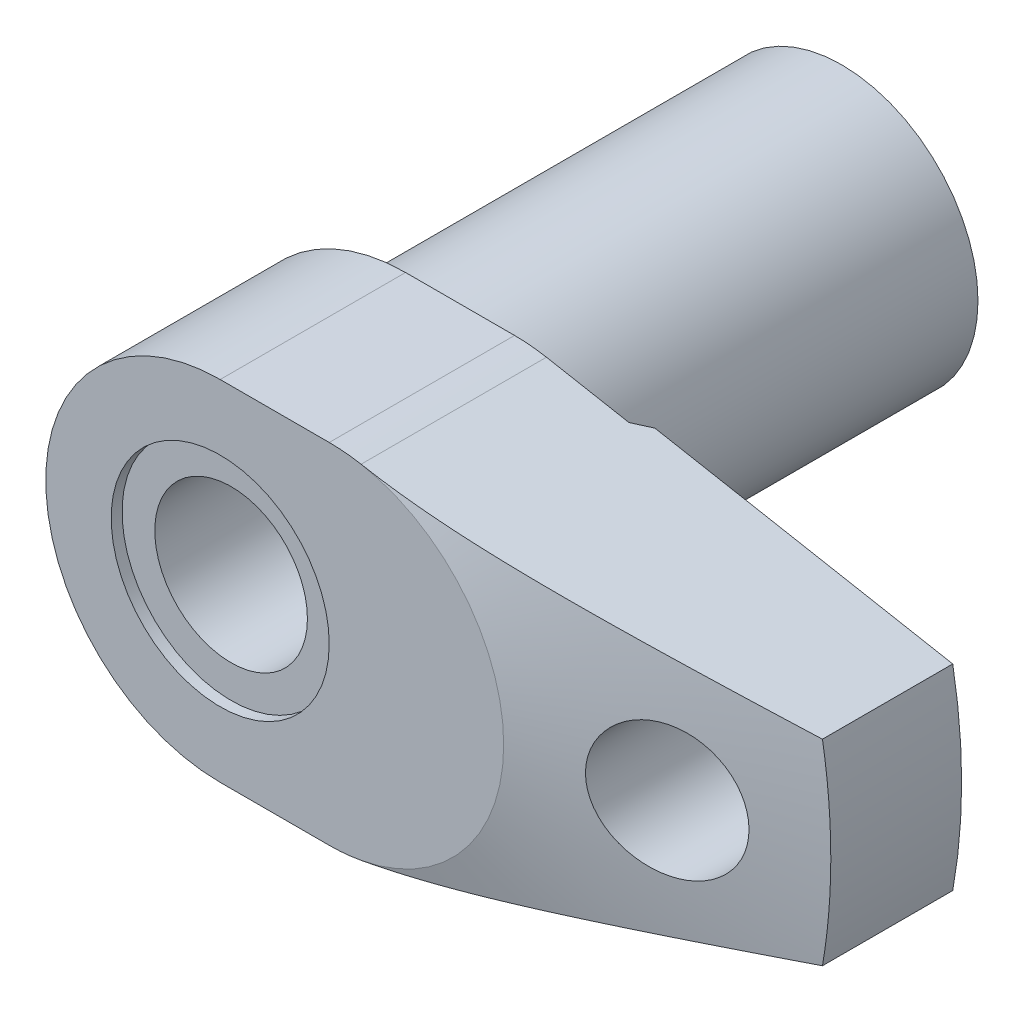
ISO-10303-21;
HEADER;
FILE_DESCRIPTION(('STEP AP214'),'2;1');
FILE_NAME('part.step','',(''),(''),'','','');
FILE_SCHEMA(('AUTOMOTIVE_DESIGN { 1 0 10303 214 1 1 1 1 }'));
ENDSEC;
DATA;
#1=APPLICATION_CONTEXT('core data for automotive mechanical design processes');
#2=APPLICATION_PROTOCOL_DEFINITION('international standard','automotive_design',2000,#1);
#3=PRODUCT_CONTEXT('',#1,'mechanical');
#4=PRODUCT('Part','Part','',(#3));
#5=PRODUCT_RELATED_PRODUCT_CATEGORY('part','',(#4));
#6=PRODUCT_DEFINITION_FORMATION('','',#4);
#7=PRODUCT_DEFINITION_CONTEXT('part definition',#1,'design');
#8=PRODUCT_DEFINITION('design','',#6,#7);
#9=PRODUCT_DEFINITION_SHAPE('','',#8);
#10=(LENGTH_UNIT() NAMED_UNIT(*) SI_UNIT(.MILLI.,.METRE.));
#11=(NAMED_UNIT(*) PLANE_ANGLE_UNIT() SI_UNIT($,.RADIAN.));
#12=(NAMED_UNIT(*) SI_UNIT($,.STERADIAN.) SOLID_ANGLE_UNIT());
#13=UNCERTAINTY_MEASURE_WITH_UNIT(LENGTH_MEASURE(1.E-05),#10,'distance_accuracy_value','');
#14=(GEOMETRIC_REPRESENTATION_CONTEXT(3) GLOBAL_UNCERTAINTY_ASSIGNED_CONTEXT((#13)) GLOBAL_UNIT_ASSIGNED_CONTEXT((#10,
#11,#12)) REPRESENTATION_CONTEXT('',''));
#15=CARTESIAN_POINT('',(0.,0.,0.));
#16=DIRECTION('',(0.,0.,1.));
#17=DIRECTION('',(1.,0.,0.));
#18=AXIS2_PLACEMENT_3D('',#15,#16,#17);
#19=CARTESIAN_POINT('',(49.1833305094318,-9.,39.));
#20=DIRECTION('',(0.182505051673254,-0.983204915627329,0.));
#21=DIRECTION('',(0.983204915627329,0.182505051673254,0.));
#22=AXIS2_PLACEMENT_3D('',#19,#20,#21);
#23=PLANE('',#22);
#24=DIRECTION('',(0.,0.,1.));
#25=VECTOR('',#24,1.);
#26=CARTESIAN_POINT('',(49.1833305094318,-9.,39.));
#27=LINE('',#26,#25);
#28=CARTESIAN_POINT('',(49.1833305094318,-9.,39.));
#29=VERTEX_POINT('',#28);
#30=CARTESIAN_POINT('',(49.1833305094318,-9.,50.9490877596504));
#31=VERTEX_POINT('',#30);
#32=EDGE_CURVE('E142',#29,#31,#27,.T.);
#33=ORIENTED_EDGE('',*,*,#32,.T.);
#34=CARTESIAN_POINT('',(49.1835305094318,-8.99996287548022,50.9490411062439));
#35=CARTESIAN_POINT('',(48.4363157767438,-9.1386628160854,51.1233294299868));
#36=CARTESIAN_POINT('',(47.6889224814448,-9.27739590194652,51.2968298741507));
#37=CARTESIAN_POINT('',(46.1937064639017,-9.5549417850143,51.6419204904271));
#38=CARTESIAN_POINT('',(45.4458837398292,-9.69375458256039,51.813510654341));
#39=CARTESIAN_POINT('',(43.9498561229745,-9.97145111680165,52.1544189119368));
#40=CARTESIAN_POINT('',(43.2016513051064,-10.1103348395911,52.3237373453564));
#41=CARTESIAN_POINT('',(41.7046595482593,-10.3882103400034,52.6596906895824));
#42=CARTESIAN_POINT('',(40.9558726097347,-10.527202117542,52.8263256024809));
#43=CARTESIAN_POINT('',(39.4594248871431,-10.8049766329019,53.1559693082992));
#44=CARTESIAN_POINT('',(38.7117657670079,-10.94375906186,53.3189859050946));
#45=CARTESIAN_POINT('',(37.2156374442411,-11.2214742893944,53.641125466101));
#46=CARTESIAN_POINT('',(36.4671682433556,-11.3604070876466,53.8002484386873));
#47=CARTESIAN_POINT('',(34.9690951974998,-11.6384832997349,54.1137697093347));
#48=CARTESIAN_POINT('',(34.2194911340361,-11.7776267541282,54.2681669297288));
#49=CARTESIAN_POINT('',(32.7191323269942,-12.0561272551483,54.571090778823));
#50=CARTESIAN_POINT('',(31.9683775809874,-12.1954843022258,54.7196173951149));
#51=CARTESIAN_POINT('',(30.4629252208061,-12.4749302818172,55.0098772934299));
#52=CARTESIAN_POINT('',(29.7082229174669,-12.6150200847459,55.1515855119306));
#53=CARTESIAN_POINT('',(28.1972026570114,-12.8954995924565,55.4258274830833));
#54=CARTESIAN_POINT('',(27.4408847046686,-13.0358892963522,55.5583612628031));
#55=CARTESIAN_POINT('',(25.9267833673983,-13.3169407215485,55.8118665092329));
#56=CARTESIAN_POINT('',(25.1690009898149,-13.4576022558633,55.9328441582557));
#57=CARTESIAN_POINT('',(23.6513180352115,-13.7393185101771,56.1604558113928));
#58=CARTESIAN_POINT('',(22.8914174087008,-13.8803732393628,56.267089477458));
#59=CARTESIAN_POINT('',(21.3673908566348,-14.163267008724,56.4628797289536));
#60=CARTESIAN_POINT('',(20.6032590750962,-14.3051071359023,56.5519896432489));
#61=CARTESIAN_POINT('',(19.0728856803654,-14.5891790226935,56.7086223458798));
#62=CARTESIAN_POINT('',(18.3066442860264,-14.7314107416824,56.7761472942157));
#63=CARTESIAN_POINT('',(17.1552699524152,-14.9451318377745,56.8586386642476));
#64=CARTESIAN_POINT('',(16.7707772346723,-15.0165023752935,56.8830172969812));
#65=CARTESIAN_POINT('',(16.0014376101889,-15.1593091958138,56.92510762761));
#66=CARTESIAN_POINT('',(15.6165907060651,-15.2307454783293,56.9428193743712));
#67=CARTESIAN_POINT('',(14.8465043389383,-15.3736909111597,56.9712828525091));
#68=CARTESIAN_POINT('',(14.4612647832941,-15.4452000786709,56.9820320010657));
#69=CARTESIAN_POINT('',(13.6906447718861,-15.5882445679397,56.9964020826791));
#70=CARTESIAN_POINT('',(13.3052643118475,-15.6597798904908,57.0000227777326));
#71=CARTESIAN_POINT('',(12.9198808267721,-15.731315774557,56.9999999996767));
#72=B_SPLINE_CURVE_WITH_KNOTS('',3,(#34,#35,#36,#37,#38,#39,#40,#41,#42,#43,#44,#45,#46,#47,#48,
#49,#50,#51,#52,#53,#54,#55,#56,#57,#58,#59,#60,#61,#62,#63,#64,#65,#66,#67,#68,#69,#70,#71),
.UNSPECIFIED.,.F.,.F.,(4,2,2,2,2,2,2,2,2,2,2,2,2,2,2,2,2,2,4),(0.,2.33912374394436,
4.67825752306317,7.01703749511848,9.35581564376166,11.6889301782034,14.0220396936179,
16.3556773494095,18.689319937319,21.0309713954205,23.372615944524,25.7130006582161,
28.0534405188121,30.4000316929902,32.7463879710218,33.9217995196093,35.0972024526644,
36.2730411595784,37.4489191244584),.UNSPECIFIED.);
#73=CARTESIAN_POINT('',(12.9200808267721,-15.7312786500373,57.));
#74=VERTEX_POINT('',#73);
#75=EDGE_CURVE('E35',#31,#74,#72,.T.);
#76=ORIENTED_EDGE('',*,*,#75,.T.);
#77=DIRECTION('',(0.,0.,1.));
#78=VECTOR('',#77,1.);
#79=CARTESIAN_POINT('',(12.9200808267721,-15.7312786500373,39.));
#80=LINE('',#79,#78);
#81=CARTESIAN_POINT('',(12.9200808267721,-15.7312786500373,40.));
#82=VERTEX_POINT('',#81);
#83=EDGE_CURVE('E146',#82,#74,#80,.T.);
#84=ORIENTED_EDGE('',*,*,#83,.F.);
#85=DIRECTION('',(-0.983204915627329,-0.182505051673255,0.));
#86=VECTOR('',#85,1.);
#87=CARTESIAN_POINT('',(20.4878093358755,-14.3265372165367,40.));
#88=LINE('',#87,#86);
#89=CARTESIAN_POINT('',(20.4878093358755,-14.3265372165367,40.));
#90=VERTEX_POINT('',#89);
#91=EDGE_CURVE('E418',#90,#82,#88,.T.);
#92=ORIENTED_EDGE('',*,*,#91,.F.);
#93=CARTESIAN_POINT('',(21.8634927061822,-14.0711792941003,38.9998));
#94=CARTESIAN_POINT('',(21.7495401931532,-14.092331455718,39.0841746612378));
#95=CARTESIAN_POINT('',(21.6354174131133,-14.1135152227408,39.1683116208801));
#96=CARTESIAN_POINT('',(21.4068219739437,-14.1559477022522,39.3360875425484));
#97=CARTESIAN_POINT('',(21.2923493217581,-14.177196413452,39.4197265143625));
#98=CARTESIAN_POINT('',(21.0630401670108,-14.2197613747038,39.586487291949));
#99=CARTESIAN_POINT('',(20.948203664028,-14.2410776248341,39.6696090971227));
#100=CARTESIAN_POINT('',(20.7181524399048,-14.2837803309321,39.8353143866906));
#101=CARTESIAN_POINT('',(20.60293771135,-14.305166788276,39.917897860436));
#102=CARTESIAN_POINT('',(20.4875288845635,-14.3265892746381,40.0002));
#103=B_SPLINE_CURVE_WITH_KNOTS('',3,(#93,#94,#95,#96,#97,#98,#99,#100,#101,#102),.UNSPECIFIED.,
.F.,.F.,(4,2,2,2,4),(0.,0.430075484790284,0.860142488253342,1.29020998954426,1.72028597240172),.UNSPECIFIED.);
#104=CARTESIAN_POINT('',(21.8632225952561,-14.0712294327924,39.));
#105=VERTEX_POINT('',#104);
#106=EDGE_CURVE('E192',#105,#90,#103,.T.);
#107=ORIENTED_EDGE('',*,*,#106,.F.);
#108=DIRECTION('',(0.983204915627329,0.182505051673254,0.));
#109=VECTOR('',#108,1.);
#110=CARTESIAN_POINT('',(49.1833305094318,-9.,39.));
#111=LINE('',#110,#109);
#112=EDGE_CURVE('E136',#105,#29,#111,.T.);
#113=ORIENTED_EDGE('',*,*,#112,.T.);
#114=EDGE_LOOP('',(#33,#76,#84,#92,#107,#113));
#115=FACE_BOUND('',#114,.T.);
#116=ADVANCED_FACE('F14',(#115),#23,.T.);
#117=CARTESIAN_POINT('',(49.1833305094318,9.,39.));
#118=DIRECTION('',(0.182505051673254,0.983204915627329,0.));
#119=DIRECTION('',(-0.983204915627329,0.182505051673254,0.));
#120=AXIS2_PLACEMENT_3D('',#117,#118,#119);
#121=PLANE('',#120);
#122=DIRECTION('',(0.,0.,1.));
#123=VECTOR('',#122,1.);
#124=CARTESIAN_POINT('',(12.9200808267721,15.7312786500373,39.));
#125=LINE('',#124,#123);
#126=CARTESIAN_POINT('',(12.9200808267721,15.7312786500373,40.));
#127=VERTEX_POINT('',#126);
#128=CARTESIAN_POINT('',(12.9200808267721,15.7312786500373,57.));
#129=VERTEX_POINT('',#128);
#130=EDGE_CURVE('E116',#127,#129,#125,.T.);
#131=ORIENTED_EDGE('',*,*,#130,.T.);
#132=CARTESIAN_POINT('',(12.9198808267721,15.731315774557,56.9999999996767));
#133=CARTESIAN_POINT('',(13.2556839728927,15.6689831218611,57.000013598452));
#134=CARTESIAN_POINT('',(13.5914855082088,15.6066507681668,56.9972685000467));
#135=CARTESIAN_POINT('',(14.2629969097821,15.4820030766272,56.9863525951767));
#136=CARTESIAN_POINT('',(14.598706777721,15.4196877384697,56.9781818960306));
#137=CARTESIAN_POINT('',(15.2698792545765,15.2951029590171,56.9565090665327));
#138=CARTESIAN_POINT('',(15.6053419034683,15.2328335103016,56.9430082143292));
#139=CARTESIAN_POINT('',(16.2760267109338,15.1083392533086,56.9108512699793));
#140=CARTESIAN_POINT('',(16.6112488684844,15.0461144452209,56.8921951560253));
#141=CARTESIAN_POINT('',(17.6154285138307,14.8597160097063,56.8288816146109));
#142=CARTESIAN_POINT('',(18.2839458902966,14.7356240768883,56.7768438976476));
#143=CARTESIAN_POINT('',(19.6194519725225,14.4877239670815,56.6552810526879));
#144=CARTESIAN_POINT('',(20.2864405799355,14.3639158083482,56.5857548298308));
#145=CARTESIAN_POINT('',(21.6170626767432,14.1169222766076,56.4318958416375));
#146=CARTESIAN_POINT('',(22.2807003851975,13.9937361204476,56.347600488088));
#147=CARTESIAN_POINT('',(23.6062973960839,13.7476753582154,56.1664804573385));
#148=CARTESIAN_POINT('',(24.268256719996,13.624800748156,56.0696559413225));
#149=CARTESIAN_POINT('',(25.5909090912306,13.3792865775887,55.8655833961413));
#150=CARTESIAN_POINT('',(26.2516014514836,13.2566471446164,55.7583307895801));
#151=CARTESIAN_POINT('',(27.5715919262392,13.0116270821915,55.5352732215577));
#152=CARTESIAN_POINT('',(28.2308900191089,12.8892464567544,55.419468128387));
#153=CARTESIAN_POINT('',(29.7391756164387,12.6092745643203,55.1462586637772));
#154=CARTESIAN_POINT('',(30.5877543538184,12.4517591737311,54.9865259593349));
#155=CARTESIAN_POINT('',(32.2832079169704,12.1370446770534,54.657987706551));
#156=CARTESIAN_POINT('',(33.1300827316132,11.9798455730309,54.4891820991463));
#157=CARTESIAN_POINT('',(34.8223003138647,11.6657317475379,54.1444787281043));
#158=CARTESIAN_POINT('',(35.6676432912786,11.5088169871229,53.9685820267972));
#159=CARTESIAN_POINT('',(37.3571768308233,11.1952013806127,53.6111544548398));
#160=CARTESIAN_POINT('',(38.2013673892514,11.0385005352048,53.429623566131));
#161=CARTESIAN_POINT('',(39.8914780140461,10.7247778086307,53.0614697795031));
#162=CARTESIAN_POINT('',(40.7373950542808,10.5677564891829,52.874832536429));
#163=CARTESIAN_POINT('',(42.4284393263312,10.2538604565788,52.4978887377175));
#164=CARTESIAN_POINT('',(43.2735665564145,10.096985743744,52.3075821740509));
#165=CARTESIAN_POINT('',(44.963151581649,9.78336058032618,51.9239804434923));
#166=CARTESIAN_POINT('',(45.807609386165,9.62661012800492,51.7306853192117));
#167=CARTESIAN_POINT('',(47.4959636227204,9.31321342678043,51.3416056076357));
#168=CARTESIAN_POINT('',(48.3398600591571,9.15656717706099,51.1458210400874));
#169=CARTESIAN_POINT('',(49.1835305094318,8.99996287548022,50.9490411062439));
#170=B_SPLINE_CURVE_WITH_KNOTS('',3,(#132,#133,#134,#135,#136,#137,#138,#139,#140,#141,#142,
#143,#144,#145,#146,#147,#148,#149,#150,#151,#152,#153,#154,#155,#156,#157,#158,#159,#160,#161,
#162,#163,#164,#165,#166,#167,#168,#169),.UNSPECIFIED.,.F.,.F.,(4,2,2,2,2,2,2,2,2,2,2,2,2,2,2,2,
2,2,4),(0.,1.02460419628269,2.04918812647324,3.07352651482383,4.09786923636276,6.14336042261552,
8.18897969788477,10.2294902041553,12.2699744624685,14.3113584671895,16.3527739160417,
18.9859001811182,21.6190435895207,24.2517939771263,26.8845528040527,29.5256759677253,
32.1668049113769,34.8078962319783,37.4489666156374),.UNSPECIFIED.);
#171=CARTESIAN_POINT('',(49.1833305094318,9.,50.9490877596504));
#172=VERTEX_POINT('',#171);
#173=EDGE_CURVE('E94',#129,#172,#170,.T.);
#174=ORIENTED_EDGE('',*,*,#173,.T.);
#175=DIRECTION('',(0.,0.,1.));
#176=VECTOR('',#175,1.);
#177=CARTESIAN_POINT('',(49.1833305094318,9.,39.));
#178=LINE('',#177,#176);
#179=CARTESIAN_POINT('',(49.1833305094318,9.,39.));
#180=VERTEX_POINT('',#179);
#181=EDGE_CURVE('E122',#180,#172,#178,.T.);
#182=ORIENTED_EDGE('',*,*,#181,.F.);
#183=DIRECTION('',(-0.983204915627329,0.182505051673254,0.));
#184=VECTOR('',#183,1.);
#185=CARTESIAN_POINT('',(49.1833305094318,9.,39.));
#186=LINE('',#185,#184);
#187=CARTESIAN_POINT('',(21.8632225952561,14.0712294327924,39.));
#188=VERTEX_POINT('',#187);
#189=EDGE_CURVE('E427',#180,#188,#186,.T.);
#190=ORIENTED_EDGE('',*,*,#189,.T.);
#191=CARTESIAN_POINT('',(20.4875288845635,14.3265892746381,40.0002));
#192=CARTESIAN_POINT('',(20.60293771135,14.305166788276,39.917897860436));
#193=CARTESIAN_POINT('',(20.7181524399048,14.2837803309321,39.8353143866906));
#194=CARTESIAN_POINT('',(20.948203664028,14.2410776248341,39.6696090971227));
#195=CARTESIAN_POINT('',(21.0630401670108,14.2197613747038,39.586487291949));
#196=CARTESIAN_POINT('',(21.2923493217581,14.177196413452,39.4197265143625));
#197=CARTESIAN_POINT('',(21.4068219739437,14.1559477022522,39.3360875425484));
#198=CARTESIAN_POINT('',(21.6354174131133,14.1135152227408,39.1683116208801));
#199=CARTESIAN_POINT('',(21.7495401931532,14.092331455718,39.0841746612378));
#200=CARTESIAN_POINT('',(21.8634927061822,14.0711792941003,38.9998));
#201=B_SPLINE_CURVE_WITH_KNOTS('',3,(#191,#192,#193,#194,#195,#196,#197,#198,#199,#200),
.UNSPECIFIED.,.F.,.F.,(4,2,2,2,4),(0.,0.430075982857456,0.860143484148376,1.29021048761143,
1.72028597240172),.UNSPECIFIED.);
#202=CARTESIAN_POINT('',(20.4878093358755,14.3265372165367,40.));
#203=VERTEX_POINT('',#202);
#204=EDGE_CURVE('E9',#203,#188,#201,.T.);
#205=ORIENTED_EDGE('',*,*,#204,.F.);
#206=DIRECTION('',(0.983204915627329,-0.182505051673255,0.));
#207=VECTOR('',#206,1.);
#208=CARTESIAN_POINT('',(12.9200808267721,15.7312786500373,40.));
#209=LINE('',#208,#207);
#210=EDGE_CURVE('E43',#127,#203,#209,.T.);
#211=ORIENTED_EDGE('',*,*,#210,.F.);
#212=EDGE_LOOP('',(#131,#174,#182,#190,#205,#211));
#213=FACE_BOUND('',#212,.T.);
#214=ADVANCED_FACE('F117',(#213),#121,.T.);
#215=CARTESIAN_POINT('',(0.,0.,57.));
#216=DIRECTION('',(0.,0.,1.));
#217=DIRECTION('',(1.,0.,0.));
#218=AXIS2_PLACEMENT_3D('',#215,#216,#217);
#219=PLANE('',#218);
#220=CARTESIAN_POINT('',(0.,0.,57.));
#221=DIRECTION('',(0.,0.,1.));
#222=DIRECTION('',(1.,0.,0.));
#223=AXIS2_PLACEMENT_3D('',#220,#221,#222);
#224=CIRCLE('',#223,10.);
#225=CARTESIAN_POINT('',(10.,0.,57.));
#226=VERTEX_POINT('',#225);
#227=EDGE_CURVE('E145',#226,#226,#224,.T.);
#228=ORIENTED_EDGE('',*,*,#227,.F.);
#229=EDGE_LOOP('',(#228));
#230=FACE_BOUND('',#229,.T.);
#231=CARTESIAN_POINT('',(10.,0.,57.));
#232=DIRECTION('',(0.,0.,1.));
#233=DIRECTION('',(1.,0.,0.));
#234=AXIS2_PLACEMENT_3D('',#231,#232,#233);
#235=CIRCLE('',#234,16.);
#236=CARTESIAN_POINT('',(10.,-16.,57.));
#237=VERTEX_POINT('',#236);
#238=EDGE_CURVE('E113',#237,#74,#235,.T.);
#239=ORIENTED_EDGE('',*,*,#238,.T.);
#240=CARTESIAN_POINT('',(10.,0.,57.));
#241=DIRECTION('',(0.,0.,-1.));
#242=DIRECTION('',(-1.,0.,0.));
#243=AXIS2_PLACEMENT_3D('',#240,#241,#242);
#244=CIRCLE('',#243,16.);
#245=EDGE_CURVE('E98',#129,#74,#244,.T.);
#246=ORIENTED_EDGE('',*,*,#245,.F.);
#247=CARTESIAN_POINT('',(10.,0.,57.));
#248=DIRECTION('',(0.,0.,1.));
#249=DIRECTION('',(1.,0.,0.));
#250=AXIS2_PLACEMENT_3D('',#247,#248,#249);
#251=CIRCLE('',#250,16.);
#252=CARTESIAN_POINT('',(10.,16.,57.));
#253=VERTEX_POINT('',#252);
#254=EDGE_CURVE('E110',#129,#253,#251,.T.);
#255=ORIENTED_EDGE('',*,*,#254,.T.);
#256=DIRECTION('',(-1.,0.,0.));
#257=VECTOR('',#256,1.);
#258=CARTESIAN_POINT('',(10.,16.,57.));
#259=LINE('',#258,#257);
#260=CARTESIAN_POINT('',(0.,16.,57.));
#261=VERTEX_POINT('',#260);
#262=EDGE_CURVE('E127',#253,#261,#259,.T.);
#263=ORIENTED_EDGE('',*,*,#262,.T.);
#264=CARTESIAN_POINT('',(0.,0.,57.));
#265=DIRECTION('',(0.,0.,1.));
#266=DIRECTION('',(1.,0.,0.));
#267=AXIS2_PLACEMENT_3D('',#264,#265,#266);
#268=CIRCLE('',#267,16.);
#269=CARTESIAN_POINT('',(1.6759120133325E-13,-16.,57.));
#270=VERTEX_POINT('',#269);
#271=EDGE_CURVE('E28',#261,#270,#268,.T.);
#272=ORIENTED_EDGE('',*,*,#271,.T.);
#273=DIRECTION('',(1.,0.,0.));
#274=VECTOR('',#273,1.);
#275=CARTESIAN_POINT('',(1.6759120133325E-13,-16.,57.));
#276=LINE('',#275,#274);
#277=EDGE_CURVE('E130',#270,#237,#276,.T.);
#278=ORIENTED_EDGE('',*,*,#277,.T.);
#279=EDGE_LOOP('',(#239,#246,#255,#263,#272,#278));
#280=FACE_BOUND('',#279,.T.);
#281=ADVANCED_FACE('F107',(#230,#280),#219,.T.);
#282=CARTESIAN_POINT('',(0.,0.,39.));
#283=DIRECTION('',(0.,0.,1.));
#284=DIRECTION('',(1.,0.,0.));
#285=AXIS2_PLACEMENT_3D('',#282,#283,#284);
#286=CYLINDRICAL_SURFACE('',#285,50.);
#287=ORIENTED_EDGE('',*,*,#181,.T.);
#288=CARTESIAN_POINT('',(49.1832939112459,9.0002,50.9490854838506));
#289=CARTESIAN_POINT('',(49.3196030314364,8.25538525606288,50.9575623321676));
#290=CARTESIAN_POINT('',(49.4389702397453,7.50745839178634,50.9649950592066));
#291=CARTESIAN_POINT('',(49.6436263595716,6.00694322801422,50.9777491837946));
#292=CARTESIAN_POINT('',(49.7289154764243,5.25435495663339,50.9830705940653));
#293=CARTESIAN_POINT('',(49.8646672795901,3.75221544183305,50.9915444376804));
#294=CARTESIAN_POINT('',(49.9154080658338,3.00268941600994,50.9947141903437));
#295=CARTESIAN_POINT('',(49.9830743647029,1.50210892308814,50.9989419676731));
#296=CARTESIAN_POINT('',(50.,0.751054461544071,51.));
#297=CARTESIAN_POINT('',(50.,-0.751054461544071,51.));
#298=CARTESIAN_POINT('',(49.9830743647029,-1.50210892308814,50.9989419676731));
#299=CARTESIAN_POINT('',(49.9154080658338,-3.00268941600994,50.9947141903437));
#300=CARTESIAN_POINT('',(49.8646672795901,-3.75221544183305,50.9915444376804));
#301=CARTESIAN_POINT('',(49.7289154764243,-5.25435495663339,50.9830705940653));
#302=CARTESIAN_POINT('',(49.6436263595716,-6.00694322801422,50.9777491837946));
#303=CARTESIAN_POINT('',(49.4389702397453,-7.50745839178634,50.9649950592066));
#304=CARTESIAN_POINT('',(49.3196030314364,-8.25538525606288,50.9575623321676));
#305=CARTESIAN_POINT('',(49.1832939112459,-9.0002,50.9490854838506));
#306=B_SPLINE_CURVE_WITH_KNOTS('',3,(#288,#289,#290,#291,#292,#293,#294,#295,#296,#297,#298,
#299,#300,#301,#302,#303,#304,#305),.UNSPECIFIED.,.F.,.F.,(4,2,2,2,2,2,2,2,4),(0.,
2.27150161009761,4.54298953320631,6.79596960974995,9.04894151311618,11.3019134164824,
13.5548934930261,15.8263814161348,18.0978830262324),.UNSPECIFIED.);
#307=EDGE_CURVE('E99',#172,#31,#306,.T.);
#308=ORIENTED_EDGE('',*,*,#307,.T.);
#309=ORIENTED_EDGE('',*,*,#32,.F.);
#310=CARTESIAN_POINT('',(0.,0.,39.));
#311=DIRECTION('',(0.,0.,1.));
#312=DIRECTION('',(1.,0.,0.));
#313=AXIS2_PLACEMENT_3D('',#310,#311,#312);
#314=CIRCLE('',#313,50.);
#315=EDGE_CURVE('E141',#29,#180,#314,.T.);
#316=ORIENTED_EDGE('',*,*,#315,.T.);
#317=EDGE_LOOP('',(#287,#308,#309,#316));
#318=FACE_BOUND('',#317,.T.);
#319=ADVANCED_FACE('F231',(#318),#286,.T.);
#320=CARTESIAN_POINT('',(38.,0.,57.));
#321=DIRECTION('',(0.,0.,-1.));
#322=DIRECTION('',(-1.,0.,0.));
#323=AXIS2_PLACEMENT_3D('',#320,#321,#322);
#324=CYLINDRICAL_SURFACE('',#323,6.);
#325=CARTESIAN_POINT('',(38.,0.,39.));
#326=DIRECTION('',(0.,0.,-1.));
#327=DIRECTION('',(-1.,0.,0.));
#328=AXIS2_PLACEMENT_3D('',#325,#326,#327);
#329=CIRCLE('',#328,6.);
#330=CARTESIAN_POINT('',(32.,0.,39.));
#331=VERTEX_POINT('',#330);
#332=EDGE_CURVE('E215',#331,#331,#329,.T.);
#333=ORIENTED_EDGE('',*,*,#332,.T.);
#334=EDGE_LOOP('',(#333));
#335=FACE_BOUND('',#334,.T.);
#336=CARTESIAN_POINT('',(33.7863716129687,-4.27145593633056,54.9582866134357));
#337=CARTESIAN_POINT('',(33.6691197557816,-4.15579451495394,54.9922486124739));
#338=CARTESIAN_POINT('',(33.5565029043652,-4.03517203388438,55.0251556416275));
#339=CARTESIAN_POINT('',(33.3412734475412,-3.78464411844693,55.0885314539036));
#340=CARTESIAN_POINT('',(33.2386627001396,-3.65473696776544,55.1189997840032));
#341=CARTESIAN_POINT('',(33.0442174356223,-3.38639799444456,55.1771478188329));
#342=CARTESIAN_POINT('',(32.9523886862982,-3.24796166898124,55.2048260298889));
#343=CARTESIAN_POINT('',(32.7802702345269,-2.96345581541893,55.2570366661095));
#344=CARTESIAN_POINT('',(32.6999845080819,-2.81738368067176,55.2815680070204));
#345=CARTESIAN_POINT('',(32.551573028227,-2.51843721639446,55.3271676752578));
#346=CARTESIAN_POINT('',(32.483462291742,-2.36555477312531,55.3482317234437));
#347=CARTESIAN_POINT('',(32.3601215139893,-2.05421645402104,55.3865524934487));
#348=CARTESIAN_POINT('',(32.3048912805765,-1.89576066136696,55.4038092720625));
#349=CARTESIAN_POINT('',(32.2078312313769,-1.57446352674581,55.4342438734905));
#350=CARTESIAN_POINT('',(32.1659974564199,-1.41162349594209,55.4474229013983));
#351=CARTESIAN_POINT('',(32.0961055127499,-1.08272477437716,55.4694944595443));
#352=CARTESIAN_POINT('',(32.0680472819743,-0.916666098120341,55.4783870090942));
#353=CARTESIAN_POINT('',(32.026585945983,-0.587416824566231,55.4915435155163));
#354=CARTESIAN_POINT('',(32.0127840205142,-0.424281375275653,55.4959334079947));
#355=CARTESIAN_POINT('',(31.998557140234,-0.0973116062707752,55.5004586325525));
#356=CARTESIAN_POINT('',(31.9981367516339,0.0665229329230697,55.5005925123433));
#357=CARTESIAN_POINT('',(32.010686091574,0.393553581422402,55.4966005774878));
#358=CARTESIAN_POINT('',(32.023649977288,0.556749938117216,55.4924766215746));
#359=CARTESIAN_POINT('',(32.0628447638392,0.881440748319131,55.4800366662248));
#360=CARTESIAN_POINT('',(32.0890805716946,1.04293454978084,55.4717191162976));
#361=CARTESIAN_POINT('',(32.154029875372,1.36030400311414,55.4511976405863));
#362=CARTESIAN_POINT('',(32.1925266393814,1.51622845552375,55.4390612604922));
#363=CARTESIAN_POINT('',(32.2817931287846,1.82423486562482,55.4110401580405));
#364=CARTESIAN_POINT('',(32.3325672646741,1.97631542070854,55.3951540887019));
#365=CARTESIAN_POINT('',(32.4459448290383,2.27553231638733,55.3598654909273));
#366=CARTESIAN_POINT('',(32.5085445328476,2.42267019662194,55.34046406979));
#367=CARTESIAN_POINT('',(32.6450692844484,2.71113022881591,55.2984049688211));
#368=CARTESIAN_POINT('',(32.7189985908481,2.85245016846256,55.2757460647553));
#369=CARTESIAN_POINT('',(32.9603251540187,3.27216400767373,55.2022797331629));
#370=CARTESIAN_POINT('',(33.1449108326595,3.54011674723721,55.1467234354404));
#371=CARTESIAN_POINT('',(33.5534145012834,4.04136387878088,55.0258390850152));
#372=CARTESIAN_POINT('',(33.7773398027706,4.27465181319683,54.9605092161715));
#373=CARTESIAN_POINT('',(34.2682727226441,4.71021796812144,54.8198633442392));
#374=CARTESIAN_POINT('',(34.5366663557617,4.91084061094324,54.744248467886));
#375=CARTESIAN_POINT('',(35.1019633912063,5.26427454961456,54.5880600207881));
#376=CARTESIAN_POINT('',(35.3988719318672,5.417077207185,54.5074855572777));
#377=CARTESIAN_POINT('',(36.023582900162,5.67554197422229,54.3411954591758));
#378=CARTESIAN_POINT('',(36.3520852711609,5.77946271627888,54.2553979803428));
#379=CARTESIAN_POINT('',(37.022011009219,5.9297058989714,54.0837574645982));
#380=CARTESIAN_POINT('',(37.3634355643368,5.97602303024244,53.9979144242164));
#381=CARTESIAN_POINT('',(38.0539823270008,6.00982760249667,53.8273924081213));
#382=CARTESIAN_POINT('',(38.4031475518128,5.99658360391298,53.7427407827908));
#383=CARTESIAN_POINT('',(39.0949211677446,5.90954045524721,53.5778014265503));
#384=CARTESIAN_POINT('',(39.4375296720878,5.83574235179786,53.4975136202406));
#385=CARTESIAN_POINT('',(40.1033346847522,5.62995812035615,53.3437908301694));
#386=CARTESIAN_POINT('',(40.4266632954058,5.49843683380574,53.270306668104));
#387=CARTESIAN_POINT('',(41.0469492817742,5.18049407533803,53.1311264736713));
#388=CARTESIAN_POINT('',(41.3439092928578,4.99407809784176,53.0654296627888));
#389=CARTESIAN_POINT('',(41.8963797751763,4.57557517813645,52.9445101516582));
#390=CARTESIAN_POINT('',(42.1526073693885,4.34448868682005,52.8891024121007));
#391=CARTESIAN_POINT('',(42.6225593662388,3.84064715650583,52.7883313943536));
#392=CARTESIAN_POINT('',(42.8362893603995,3.56789760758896,52.7429667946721));
#393=CARTESIAN_POINT('',(43.2098143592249,2.995322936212,52.6641815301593));
#394=CARTESIAN_POINT('',(43.3707496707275,2.69627643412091,52.630507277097));
#395=CARTESIAN_POINT('',(43.6401645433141,2.07444344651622,52.5743624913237));
#396=CARTESIAN_POINT('',(43.7486501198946,1.75165968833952,52.5518906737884));
#397=CARTESIAN_POINT('',(43.9080890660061,1.09798425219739,52.5189281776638));
#398=CARTESIAN_POINT('',(43.9600743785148,0.767354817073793,52.5082225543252));
#399=CARTESIAN_POINT('',(44.0084014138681,0.101890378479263,52.4982689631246));
#400=CARTESIAN_POINT('',(44.0047467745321,-0.232944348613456,52.4990202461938));
#401=CARTESIAN_POINT('',(43.9422025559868,-0.894180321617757,52.5119054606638));
#402=CARTESIAN_POINT('',(43.8838018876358,-1.22062996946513,52.5239386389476));
#403=CARTESIAN_POINT('',(43.7143143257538,-1.85893173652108,52.5590044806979));
#404=CARTESIAN_POINT('',(43.6032277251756,-2.17078393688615,52.5820370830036));
#405=CARTESIAN_POINT('',(43.3314958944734,-2.77207158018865,52.6387178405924));
#406=CARTESIAN_POINT('',(43.1707089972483,-3.06143994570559,52.6723963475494));
#407=CARTESIAN_POINT('',(42.8044663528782,-3.60908302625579,52.7497199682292));
#408=CARTESIAN_POINT('',(42.5990081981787,-3.86735606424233,52.793365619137));
#409=CARTESIAN_POINT('',(42.2607163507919,-4.22777600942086,52.8659295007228));
#410=CARTESIAN_POINT('',(42.1419675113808,-4.3441562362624,52.8915107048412));
#411=CARTESIAN_POINT('',(41.8955203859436,-4.56644353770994,52.944875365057));
#412=CARTESIAN_POINT('',(41.7678251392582,-4.67235413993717,52.9726580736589));
#413=CARTESIAN_POINT('',(41.5043627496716,-4.87307844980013,53.0303010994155));
#414=CARTESIAN_POINT('',(41.3685922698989,-4.96788752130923,53.060162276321));
#415=CARTESIAN_POINT('',(41.0900457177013,-5.14576638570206,53.1217953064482));
#416=CARTESIAN_POINT('',(40.9472720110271,-5.22884010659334,53.1535665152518));
#417=CARTESIAN_POINT('',(40.6525592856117,-5.38444882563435,53.2195713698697));
#418=CARTESIAN_POINT('',(40.500489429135,-5.45671985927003,53.2538431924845));
#419=CARTESIAN_POINT('',(40.1911998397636,-5.58810027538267,53.3240355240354));
#420=CARTESIAN_POINT('',(40.0339818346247,-5.64721402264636,53.3599554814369));
#421=CARTESIAN_POINT('',(39.7153957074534,-5.75200384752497,53.4332814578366));
#422=CARTESIAN_POINT('',(39.5540259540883,-5.79767455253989,53.4706880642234));
#423=CARTESIAN_POINT('',(39.2283750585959,-5.875296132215,53.5467618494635));
#424=CARTESIAN_POINT('',(39.0640949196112,-5.90725164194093,53.5854285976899));
#425=CARTESIAN_POINT('',(38.7298866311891,-5.95789247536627,53.6647282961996));
#426=CARTESIAN_POINT('',(38.5599154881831,-5.97625563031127,53.7053860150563));
#427=CARTESIAN_POINT('',(38.2192976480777,-5.99841876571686,53.7875642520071));
#428=CARTESIAN_POINT('',(38.0486511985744,-6.00222366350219,53.8290844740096));
#429=CARTESIAN_POINT('',(37.7076932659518,-5.99530241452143,53.9127806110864));
#430=CARTESIAN_POINT('',(37.5373820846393,-5.98456651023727,53.9549569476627));
#431=CARTESIAN_POINT('',(37.1984423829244,-5.94865854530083,54.0396593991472));
#432=CARTESIAN_POINT('',(37.0298132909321,-5.92349157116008,54.0821853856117));
#433=CARTESIAN_POINT('',(36.6923933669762,-5.85834471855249,54.1680710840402));
#434=CARTESIAN_POINT('',(36.5236515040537,-5.81811294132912,54.211432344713));
#435=CARTESIAN_POINT('',(36.1902908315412,-5.7231965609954,54.2979191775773));
#436=CARTESIAN_POINT('',(36.0256705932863,-5.66851704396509,54.3410448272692));
#437=CARTESIAN_POINT('',(35.701768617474,-5.54510076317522,54.4267189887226));
#438=CARTESIAN_POINT('',(35.5424831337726,-5.47637411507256,54.4692678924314));
#439=CARTESIAN_POINT('',(35.2303184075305,-5.32531076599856,54.5534592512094));
#440=CARTESIAN_POINT('',(35.0774377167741,-5.242977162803,54.595101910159));
#441=CARTESIAN_POINT('',(34.7217758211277,-5.03100364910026,54.6929061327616));
#442=CARTESIAN_POINT('',(34.522389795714,-4.89534195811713,54.7484989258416));
#443=CARTESIAN_POINT('',(34.1407937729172,-4.60050580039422,54.856248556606));
#444=CARTESIAN_POINT('',(33.9585834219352,-4.44133181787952,54.908405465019));
#445=CARTESIAN_POINT('',(33.7863716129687,-4.27145593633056,54.9582866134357));
#446=B_SPLINE_CURVE_WITH_KNOTS('',3,(#336,#337,#338,#339,#340,#341,#342,#343,#344,#345,#346,
#347,#348,#349,#350,#351,#352,#353,#354,#355,#356,#357,#358,#359,#360,#361,#362,#363,#364,#365,
#366,#367,#368,#369,#370,#371,#372,#373,#374,#375,#376,#377,#378,#379,#380,#381,#382,#383,#384,
#385,#386,#387,#388,#389,#390,#391,#392,#393,#394,#395,#396,#397,#398,#399,#400,#401,#402,#403,
#404,#405,#406,#407,#408,#409,#410,#411,#412,#413,#414,#415,#416,#417,#418,#419,#420,#421,#422,
#423,#424,#425,#426,#427,#428,#429,#430,#431,#432,#433,#434,#435,#436,#437,#438,#439,#440,#441,
#442,#443,#444,#445),.UNSPECIFIED.,.T.,.F.,(4,2,2,2,2,2,2,2,2,2,2,2,2,2,2,2,2,2,2,2,2,2,2,2,2,2,
2,2,2,2,2,2,2,2,2,2,2,2,2,2,2,2,2,2,2,2,2,2,2,2,2,2,2,2,4),(0.,0.504291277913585,
1.00867601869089,1.51332936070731,2.01815611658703,2.52360130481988,3.02903895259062,
3.53432708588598,4.03961294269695,4.53034558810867,5.02124568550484,5.51193157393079,
6.00279901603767,6.48543084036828,6.96823630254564,7.45088994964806,7.93372546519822,
8.91916024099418,9.90477835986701,10.9306498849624,11.9567066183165,13.0169694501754,
14.0773299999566,15.1507476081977,16.2241466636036,17.2890559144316,18.3538586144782,
19.3971156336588,20.4402352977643,21.4590584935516,22.4777648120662,23.4775350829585,
24.4772399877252,25.4681012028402,26.458956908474,27.4526634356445,28.4464235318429,
28.9506247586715,29.4546555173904,29.9588960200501,30.4629673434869,30.9778397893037,
31.4925411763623,32.0074479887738,32.5221806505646,33.0487539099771,33.5751492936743,
34.1018980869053,34.628461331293,35.1642538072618,35.6998579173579,36.2350776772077,
36.7701757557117,37.5108608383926,38.2515306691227),.UNSPECIFIED.);
#447=CARTESIAN_POINT('',(33.7863716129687,-4.27145593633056,54.9582866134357));
#448=VERTEX_POINT('',#447);
#449=EDGE_CURVE('E18',#448,#448,#446,.T.);
#450=ORIENTED_EDGE('',*,*,#449,.F.);
#451=EDGE_LOOP('',(#450));
#452=FACE_BOUND('',#451,.T.);
#453=ADVANCED_FACE('F187',(#335,#452),#324,.F.);
#454=CARTESIAN_POINT('',(10.,0.,39.));
#455=DIRECTION('',(0.,0.,1.));
#456=DIRECTION('',(1.,0.,0.));
#457=AXIS2_PLACEMENT_3D('',#454,#455,#456);
#458=CYLINDRICAL_SURFACE('',#457,16.);
#459=DIRECTION('',(0.,0.,1.));
#460=VECTOR('',#459,1.);
#461=CARTESIAN_POINT('',(10.,-16.,39.));
#462=LINE('',#461,#460);
#463=CARTESIAN_POINT('',(10.,-16.,40.));
#464=VERTEX_POINT('',#463);
#465=EDGE_CURVE('E149',#464,#237,#462,.T.);
#466=ORIENTED_EDGE('',*,*,#465,.F.);
#467=CARTESIAN_POINT('',(10.,0.,40.));
#468=DIRECTION('',(0.,0.,-1.));
#469=DIRECTION('',(-1.,0.,0.));
#470=AXIS2_PLACEMENT_3D('',#467,#468,#469);
#471=CIRCLE('',#470,16.);
#472=EDGE_CURVE('E415',#82,#464,#471,.T.);
#473=ORIENTED_EDGE('',*,*,#472,.F.);
#474=ORIENTED_EDGE('',*,*,#83,.T.);
#475=ORIENTED_EDGE('',*,*,#238,.F.);
#476=EDGE_LOOP('',(#466,#473,#474,#475));
#477=FACE_BOUND('',#476,.T.);
#478=ADVANCED_FACE('F206',(#477),#458,.T.);
#479=CARTESIAN_POINT('',(1.6759120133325E-13,-16.,39.));
#480=DIRECTION('',(0.,-1.,0.));
#481=DIRECTION('',(1.,0.,0.));
#482=AXIS2_PLACEMENT_3D('',#479,#480,#481);
#483=PLANE('',#482);
#484=DIRECTION('',(0.,0.,1.));
#485=VECTOR('',#484,1.);
#486=CARTESIAN_POINT('',(1.6759120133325E-13,-16.,39.));
#487=LINE('',#486,#485);
#488=CARTESIAN_POINT('',(0.,-16.,40.));
#489=VERTEX_POINT('',#488);
#490=EDGE_CURVE('E151',#489,#270,#487,.T.);
#491=ORIENTED_EDGE('',*,*,#490,.F.);
#492=DIRECTION('',(-1.,0.,0.));
#493=VECTOR('',#492,1.);
#494=CARTESIAN_POINT('',(10.,-16.,40.));
#495=LINE('',#494,#493);
#496=EDGE_CURVE('E408',#464,#489,#495,.T.);
#497=ORIENTED_EDGE('',*,*,#496,.F.);
#498=ORIENTED_EDGE('',*,*,#465,.T.);
#499=ORIENTED_EDGE('',*,*,#277,.F.);
#500=EDGE_LOOP('',(#491,#497,#498,#499));
#501=FACE_BOUND('',#500,.T.);
#502=ADVANCED_FACE('F361',(#501),#483,.T.);
#503=CARTESIAN_POINT('',(10.,16.,39.));
#504=DIRECTION('',(0.,1.,0.));
#505=DIRECTION('',(-1.,0.,0.));
#506=AXIS2_PLACEMENT_3D('',#503,#504,#505);
#507=PLANE('',#506);
#508=DIRECTION('',(0.,0.,1.));
#509=VECTOR('',#508,1.);
#510=CARTESIAN_POINT('',(10.,16.,39.));
#511=LINE('',#510,#509);
#512=CARTESIAN_POINT('',(10.,16.,40.));
#513=VERTEX_POINT('',#512);
#514=EDGE_CURVE('E121',#513,#253,#511,.T.);
#515=ORIENTED_EDGE('',*,*,#514,.F.);
#516=DIRECTION('',(1.,0.,0.));
#517=VECTOR('',#516,1.);
#518=CARTESIAN_POINT('',(0.,16.,40.));
#519=LINE('',#518,#517);
#520=CARTESIAN_POINT('',(0.,16.,40.));
#521=VERTEX_POINT('',#520);
#522=EDGE_CURVE('E406',#521,#513,#519,.T.);
#523=ORIENTED_EDGE('',*,*,#522,.F.);
#524=DIRECTION('',(0.,0.,1.));
#525=VECTOR('',#524,1.);
#526=CARTESIAN_POINT('',(0.,16.,39.));
#527=LINE('',#526,#525);
#528=EDGE_CURVE('E153',#521,#261,#527,.T.);
#529=ORIENTED_EDGE('',*,*,#528,.T.);
#530=ORIENTED_EDGE('',*,*,#262,.F.);
#531=EDGE_LOOP('',(#515,#523,#529,#530));
#532=FACE_BOUND('',#531,.T.);
#533=ADVANCED_FACE('F356',(#532),#507,.T.);
#534=CARTESIAN_POINT('',(10.,0.,39.));
#535=DIRECTION('',(0.,0.,1.));
#536=DIRECTION('',(1.,0.,0.));
#537=AXIS2_PLACEMENT_3D('',#534,#535,#536);
#538=CYLINDRICAL_SURFACE('',#537,16.);
#539=ORIENTED_EDGE('',*,*,#130,.F.);
#540=CARTESIAN_POINT('',(10.,0.,40.));
#541=DIRECTION('',(0.,0.,-1.));
#542=DIRECTION('',(-1.,0.,0.));
#543=AXIS2_PLACEMENT_3D('',#540,#541,#542);
#544=CIRCLE('',#543,16.);
#545=EDGE_CURVE('E435',#513,#127,#544,.T.);
#546=ORIENTED_EDGE('',*,*,#545,.F.);
#547=ORIENTED_EDGE('',*,*,#514,.T.);
#548=ORIENTED_EDGE('',*,*,#254,.F.);
#549=EDGE_LOOP('',(#539,#546,#547,#548));
#550=FACE_BOUND('',#549,.T.);
#551=ADVANCED_FACE('F124',(#550),#538,.T.);
#552=CARTESIAN_POINT('',(0.,0.,57.));
#553=DIRECTION('',(0.,0.,-1.));
#554=DIRECTION('',(-1.,0.,0.));
#555=AXIS2_PLACEMENT_3D('',#552,#553,#554);
#556=CYLINDRICAL_SURFACE('',#555,7.);
#557=CARTESIAN_POINT('',(0.,0.,0.));
#558=DIRECTION('',(0.,0.,1.));
#559=DIRECTION('',(1.,0.,0.));
#560=AXIS2_PLACEMENT_3D('',#557,#558,#559);
#561=CIRCLE('',#560,7.);
#562=CARTESIAN_POINT('',(7.,0.,0.));
#563=VERTEX_POINT('',#562);
#564=EDGE_CURVE('E166',#563,#563,#561,.T.);
#565=ORIENTED_EDGE('',*,*,#564,.F.);
#566=EDGE_LOOP('',(#565));
#567=FACE_BOUND('',#566,.T.);
#568=CARTESIAN_POINT('',(0.,0.,56.));
#569=DIRECTION('',(0.,0.,1.));
#570=DIRECTION('',(1.,0.,0.));
#571=AXIS2_PLACEMENT_3D('',#568,#569,#570);
#572=CIRCLE('',#571,7.);
#573=CARTESIAN_POINT('',(7.,0.,56.));
#574=VERTEX_POINT('',#573);
#575=EDGE_CURVE('E160',#574,#574,#572,.T.);
#576=ORIENTED_EDGE('',*,*,#575,.T.);
#577=EDGE_LOOP('',(#576));
#578=FACE_BOUND('',#577,.T.);
#579=ADVANCED_FACE('F252',(#567,#578),#556,.F.);
#580=CARTESIAN_POINT('',(0.,0.,0.));
#581=DIRECTION('',(0.,0.,1.));
#582=DIRECTION('',(1.,0.,0.));
#583=AXIS2_PLACEMENT_3D('',#580,#581,#582);
#584=PLANE('',#583);
#585=ORIENTED_EDGE('',*,*,#564,.T.);
#586=EDGE_LOOP('',(#585));
#587=FACE_BOUND('',#586,.T.);
#588=CARTESIAN_POINT('',(0.,0.,0.));
#589=DIRECTION('',(0.,0.,-1.));
#590=DIRECTION('',(-1.,0.,0.));
#591=AXIS2_PLACEMENT_3D('',#588,#589,#590);
#592=CIRCLE('',#591,12.5);
#593=CARTESIAN_POINT('',(-12.5,0.,0.));
#594=VERTEX_POINT('',#593);
#595=EDGE_CURVE('E163',#594,#594,#592,.T.);
#596=ORIENTED_EDGE('',*,*,#595,.T.);
#597=EDGE_LOOP('',(#596));
#598=FACE_BOUND('',#597,.T.);
#599=ADVANCED_FACE('F255',(#587,#598),#584,.F.);
#600=CARTESIAN_POINT('',(0.,0.,57.));
#601=DIRECTION('',(0.,0.,-1.));
#602=DIRECTION('',(-1.,0.,0.));
#603=AXIS2_PLACEMENT_3D('',#600,#601,#602);
#604=CYLINDRICAL_SURFACE('',#603,16.);
#605=ORIENTED_EDGE('',*,*,#528,.F.);
#606=CARTESIAN_POINT('',(0.,0.,40.));
#607=DIRECTION('',(0.,0.,-1.));
#608=DIRECTION('',(-1.,0.,0.));
#609=AXIS2_PLACEMENT_3D('',#606,#607,#608);
#610=CIRCLE('',#609,16.);
#611=EDGE_CURVE('E133',#489,#521,#610,.T.);
#612=ORIENTED_EDGE('',*,*,#611,.F.);
#613=ORIENTED_EDGE('',*,*,#490,.T.);
#614=ORIENTED_EDGE('',*,*,#271,.F.);
#615=EDGE_LOOP('',(#605,#612,#613,#614));
#616=FACE_BOUND('',#615,.T.);
#617=ADVANCED_FACE('F16',(#616),#604,.T.);
#618=CARTESIAN_POINT('',(60.,20.,39.));
#619=DIRECTION('',(0.,0.,1.));
#620=DIRECTION('',(1.,0.,0.));
#621=AXIS2_PLACEMENT_3D('',#618,#619,#620);
#622=PLANE('',#621);
#623=ORIENTED_EDGE('',*,*,#332,.F.);
#624=EDGE_LOOP('',(#623));
#625=FACE_BOUND('',#624,.T.);
#626=ORIENTED_EDGE('',*,*,#112,.F.);
#627=CARTESIAN_POINT('',(0.,0.,39.));
#628=DIRECTION('',(0.,0.,1.));
#629=DIRECTION('',(1.,0.,0.));
#630=AXIS2_PLACEMENT_3D('',#627,#628,#629);
#631=CIRCLE('',#630,26.);
#632=EDGE_CURVE('E429',#105,#188,#631,.T.);
#633=ORIENTED_EDGE('',*,*,#632,.T.);
#634=ORIENTED_EDGE('',*,*,#189,.F.);
#635=ORIENTED_EDGE('',*,*,#315,.F.);
#636=EDGE_LOOP('',(#626,#633,#634,#635));
#637=FACE_BOUND('',#636,.T.);
#638=ADVANCED_FACE('F247',(#625,#637),#622,.F.);
#639=CARTESIAN_POINT('',(0.,0.,39.));
#640=DIRECTION('',(0.,0.,-1.));
#641=DIRECTION('',(-1.,0.,0.));
#642=AXIS2_PLACEMENT_3D('',#639,#640,#641);
#643=CYLINDRICAL_SURFACE('',#642,12.5);
#644=ORIENTED_EDGE('',*,*,#595,.F.);
#645=EDGE_LOOP('',(#644));
#646=FACE_BOUND('',#645,.T.);
#647=CARTESIAN_POINT('',(0.,0.,40.));
#648=DIRECTION('',(0.,0.,-1.));
#649=DIRECTION('',(-1.,0.,0.));
#650=AXIS2_PLACEMENT_3D('',#647,#648,#649);
#651=CIRCLE('',#650,12.5);
#652=CARTESIAN_POINT('',(-12.5,0.,40.));
#653=VERTEX_POINT('',#652);
#654=EDGE_CURVE('E128',#653,#653,#651,.T.);
#655=ORIENTED_EDGE('',*,*,#654,.T.);
#656=EDGE_LOOP('',(#655));
#657=FACE_BOUND('',#656,.T.);
#658=ADVANCED_FACE('F243',(#646,#657),#643,.T.);
#659=CARTESIAN_POINT('',(0.,0.,56.));
#660=DIRECTION('',(0.,0.,1.));
#661=DIRECTION('',(1.,0.,0.));
#662=AXIS2_PLACEMENT_3D('',#659,#660,#661);
#663=CYLINDRICAL_SURFACE('',#662,10.);
#664=CARTESIAN_POINT('',(0.,0.,56.));
#665=DIRECTION('',(0.,0.,1.));
#666=DIRECTION('',(1.,0.,0.));
#667=AXIS2_PLACEMENT_3D('',#664,#665,#666);
#668=CIRCLE('',#667,10.);
#669=CARTESIAN_POINT('',(10.,0.,56.));
#670=VERTEX_POINT('',#669);
#671=EDGE_CURVE('E157',#670,#670,#668,.T.);
#672=ORIENTED_EDGE('',*,*,#671,.F.);
#673=EDGE_LOOP('',(#672));
#674=FACE_BOUND('',#673,.T.);
#675=ORIENTED_EDGE('',*,*,#227,.T.);
#676=EDGE_LOOP('',(#675));
#677=FACE_BOUND('',#676,.T.);
#678=ADVANCED_FACE('F239',(#674,#677),#663,.F.);
#679=CARTESIAN_POINT('',(0.,0.,56.));
#680=DIRECTION('',(0.,0.,1.));
#681=DIRECTION('',(1.,0.,0.));
#682=AXIS2_PLACEMENT_3D('',#679,#680,#681);
#683=PLANE('',#682);
#684=ORIENTED_EDGE('',*,*,#575,.F.);
#685=EDGE_LOOP('',(#684));
#686=FACE_BOUND('',#685,.T.);
#687=ORIENTED_EDGE('',*,*,#671,.T.);
#688=EDGE_LOOP('',(#687));
#689=FACE_BOUND('',#688,.T.);
#690=ADVANCED_FACE('F236',(#686,#689),#683,.T.);
#691=CARTESIAN_POINT('',(-12.5,0.,40.));
#692=DIRECTION('',(0.,0.,1.));
#693=DIRECTION('',(1.,0.,0.));
#694=AXIS2_PLACEMENT_3D('',#691,#692,#693);
#695=PLANE('',#694);
#696=ORIENTED_EDGE('',*,*,#654,.F.);
#697=EDGE_LOOP('',(#696));
#698=FACE_BOUND('',#697,.T.);
#699=ORIENTED_EDGE('',*,*,#611,.T.);
#700=ORIENTED_EDGE('',*,*,#522,.T.);
#701=ORIENTED_EDGE('',*,*,#545,.T.);
#702=ORIENTED_EDGE('',*,*,#210,.T.);
#703=CARTESIAN_POINT('',(0.,0.,40.));
#704=DIRECTION('',(0.,0.,1.));
#705=DIRECTION('',(1.,0.,0.));
#706=AXIS2_PLACEMENT_3D('',#703,#704,#705);
#707=CIRCLE('',#706,25.);
#708=EDGE_CURVE('E200',#90,#203,#707,.T.);
#709=ORIENTED_EDGE('',*,*,#708,.F.);
#710=ORIENTED_EDGE('',*,*,#91,.T.);
#711=ORIENTED_EDGE('',*,*,#472,.T.);
#712=ORIENTED_EDGE('',*,*,#496,.T.);
#713=EDGE_LOOP('',(#699,#700,#701,#702,#709,#710,#711,#712));
#714=FACE_BOUND('',#713,.T.);
#715=ADVANCED_FACE('F185',(#698,#714),#695,.F.);
#716=CARTESIAN_POINT('',(0.,0.,40.));
#717=DIRECTION('',(0.,0.,-1.));
#718=DIRECTION('',(-1.,0.,0.));
#719=AXIS2_PLACEMENT_3D('',#716,#717,#718);
#720=CONICAL_SURFACE('',#719,25.,0.785398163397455);
#721=ORIENTED_EDGE('',*,*,#106,.T.);
#722=ORIENTED_EDGE('',*,*,#708,.T.);
#723=ORIENTED_EDGE('',*,*,#204,.T.);
#724=ORIENTED_EDGE('',*,*,#632,.F.);
#725=EDGE_LOOP('',(#721,#722,#723,#724));
#726=FACE_BOUND('',#725,.T.);
#727=ADVANCED_FACE('F181',(#726),#720,.F.);
#728=CARTESIAN_POINT('',(10.,0.,48.0411436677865));
#729=DIRECTION('',(0.,0.,-1.));
#730=DIRECTION('',(-1.,0.,0.));
#731=AXIS2_PLACEMENT_3D('',#728,#729,#730);
#732=CONICAL_SURFACE('',#731,51.835425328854,1.32581766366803);
#733=ORIENTED_EDGE('',*,*,#307,.F.);
#734=ORIENTED_EDGE('',*,*,#173,.F.);
#735=ORIENTED_EDGE('',*,*,#245,.T.);
#736=ORIENTED_EDGE('',*,*,#75,.F.);
#737=EDGE_LOOP('',(#733,#734,#735,#736));
#738=FACE_BOUND('',#737,.T.);
#739=ORIENTED_EDGE('',*,*,#449,.T.);
#740=EDGE_LOOP('',(#739));
#741=FACE_BOUND('',#740,.T.);
#742=ADVANCED_FACE('F96',(#738,#741),#732,.T.);
#743=CLOSED_SHELL('',(#116,#214,#281,#319,#453,#478,#502,#533,#551,#579,#599,#617,#638,#658,
#678,#690,#715,#727,#742));
#744=MANIFOLD_SOLID_BREP('B1',#743);
#745=ADVANCED_BREP_SHAPE_REPRESENTATION('',(#18,#744),#14);
#746=SHAPE_DEFINITION_REPRESENTATION(#9,#745);
ENDSEC;
END-ISO-10303-21;
